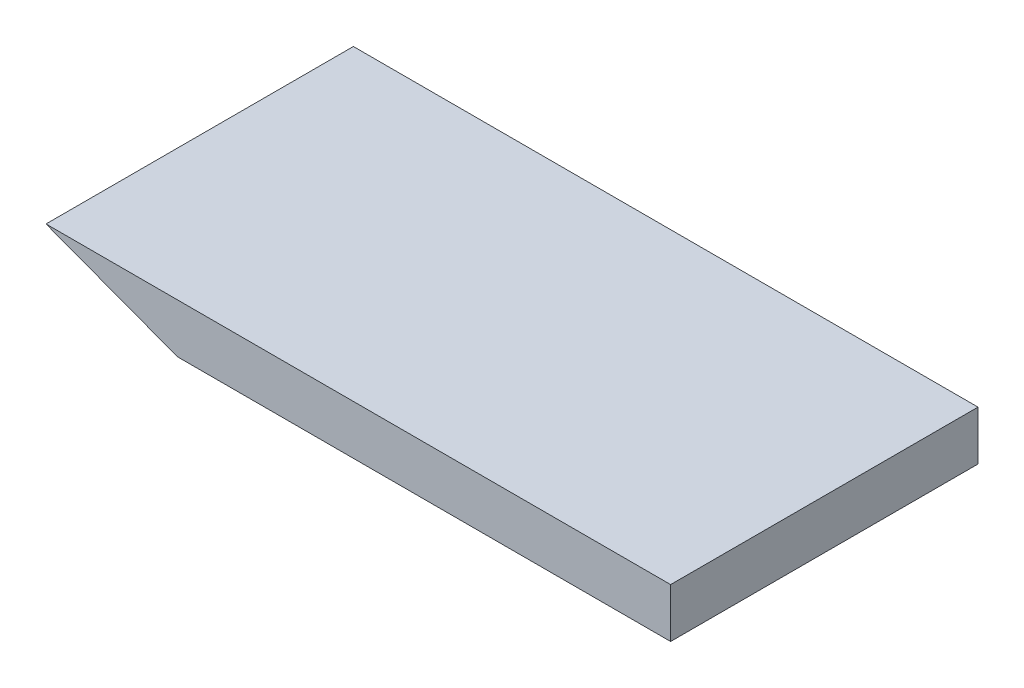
ISO-10303-21;
HEADER;
FILE_DESCRIPTION(('STEP AP214'),'2;1');
FILE_NAME('part.step','',(''),(''),'','','');
FILE_SCHEMA(('AUTOMOTIVE_DESIGN { 1 0 10303 214 1 1 1 1 }'));
ENDSEC;
DATA;
#1=APPLICATION_CONTEXT('core data for automotive mechanical design processes');
#2=APPLICATION_PROTOCOL_DEFINITION('international standard','automotive_design',2000,#1);
#3=PRODUCT_CONTEXT('',#1,'mechanical');
#4=PRODUCT('Part','Part','',(#3));
#5=PRODUCT_RELATED_PRODUCT_CATEGORY('part','',(#4));
#6=PRODUCT_DEFINITION_FORMATION('','',#4);
#7=PRODUCT_DEFINITION_CONTEXT('part definition',#1,'design');
#8=PRODUCT_DEFINITION('design','',#6,#7);
#9=PRODUCT_DEFINITION_SHAPE('','',#8);
#10=(LENGTH_UNIT() NAMED_UNIT(*) SI_UNIT(.MILLI.,.METRE.));
#11=(NAMED_UNIT(*) PLANE_ANGLE_UNIT() SI_UNIT($,.RADIAN.));
#12=(NAMED_UNIT(*) SI_UNIT($,.STERADIAN.) SOLID_ANGLE_UNIT());
#13=UNCERTAINTY_MEASURE_WITH_UNIT(LENGTH_MEASURE(1.E-05),#10,'distance_accuracy_value','');
#14=(GEOMETRIC_REPRESENTATION_CONTEXT(3) GLOBAL_UNCERTAINTY_ASSIGNED_CONTEXT((#13)) GLOBAL_UNIT_ASSIGNED_CONTEXT((#10,
#11,#12)) REPRESENTATION_CONTEXT('',''));
#15=CARTESIAN_POINT('',(0.,0.,0.));
#16=DIRECTION('',(0.,0.,1.));
#17=DIRECTION('',(1.,0.,0.));
#18=AXIS2_PLACEMENT_3D('',#15,#16,#17);
#19=CARTESIAN_POINT('',(19.,3.,-9.35));
#20=DIRECTION('',(-1.,0.,0.));
#21=DIRECTION('',(0.,0.,1.));
#22=AXIS2_PLACEMENT_3D('',#19,#20,#21);
#23=PLANE('',#22);
#24=DIRECTION('',(0.,0.,-1.));
#25=VECTOR('',#24,1.);
#26=CARTESIAN_POINT('',(19.,0.,-9.35));
#27=LINE('',#26,#25);
#28=CARTESIAN_POINT('',(19.,0.,9.35));
#29=VERTEX_POINT('',#28);
#30=CARTESIAN_POINT('',(19.,0.,-9.35));
#31=VERTEX_POINT('',#30);
#32=EDGE_CURVE('E91',#29,#31,#27,.T.);
#33=ORIENTED_EDGE('',*,*,#32,.T.);
#34=DIRECTION('',(0.,-1.,0.));
#35=VECTOR('',#34,1.);
#36=CARTESIAN_POINT('',(19.,3.,-9.35));
#37=LINE('',#36,#35);
#38=CARTESIAN_POINT('',(19.,3.,-9.35));
#39=VERTEX_POINT('',#38);
#40=EDGE_CURVE('E11',#39,#31,#37,.T.);
#41=ORIENTED_EDGE('',*,*,#40,.F.);
#42=DIRECTION('',(0.,0.,-1.));
#43=VECTOR('',#42,1.);
#44=CARTESIAN_POINT('',(19.,3.,-9.35));
#45=LINE('',#44,#43);
#46=CARTESIAN_POINT('',(19.,3.,9.35));
#47=VERTEX_POINT('',#46);
#48=EDGE_CURVE('E86',#47,#39,#45,.T.);
#49=ORIENTED_EDGE('',*,*,#48,.F.);
#50=DIRECTION('',(0.,-1.,0.));
#51=VECTOR('',#50,1.);
#52=CARTESIAN_POINT('',(19.,3.,9.35));
#53=LINE('',#52,#51);
#54=EDGE_CURVE('E48',#47,#29,#53,.T.);
#55=ORIENTED_EDGE('',*,*,#54,.T.);
#56=EDGE_LOOP('',(#33,#41,#49,#55));
#57=FACE_BOUND('',#56,.T.);
#58=ADVANCED_FACE('F39',(#57),#23,.F.);
#59=CARTESIAN_POINT('',(-19.,3.,-9.35));
#60=DIRECTION('',(0.,0.,1.));
#61=DIRECTION('',(1.,0.,0.));
#62=AXIS2_PLACEMENT_3D('',#59,#60,#61);
#63=PLANE('',#62);
#64=DIRECTION('',(-1.,0.,0.));
#65=VECTOR('',#64,1.);
#66=CARTESIAN_POINT('',(-19.,0.,-9.35));
#67=LINE('',#66,#65);
#68=CARTESIAN_POINT('',(-11.,0.,-9.35));
#69=VERTEX_POINT('',#68);
#70=EDGE_CURVE('E87',#31,#69,#67,.T.);
#71=ORIENTED_EDGE('',*,*,#70,.T.);
#72=DIRECTION('',(-0.936329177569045,0.351123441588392,0.));
#73=VECTOR('',#72,1.);
#74=CARTESIAN_POINT('',(-11.,0.,-9.35));
#75=LINE('',#74,#73);
#76=CARTESIAN_POINT('',(-19.,3.,-9.35));
#77=VERTEX_POINT('',#76);
#78=EDGE_CURVE('E55',#69,#77,#75,.T.);
#79=ORIENTED_EDGE('',*,*,#78,.T.);
#80=DIRECTION('',(-1.,0.,0.));
#81=VECTOR('',#80,1.);
#82=CARTESIAN_POINT('',(-19.,3.,-9.35));
#83=LINE('',#82,#81);
#84=EDGE_CURVE('E104',#39,#77,#83,.T.);
#85=ORIENTED_EDGE('',*,*,#84,.F.);
#86=ORIENTED_EDGE('',*,*,#40,.T.);
#87=EDGE_LOOP('',(#71,#79,#85,#86));
#88=FACE_BOUND('',#87,.T.);
#89=ADVANCED_FACE('F115',(#88),#63,.F.);
#90=CARTESIAN_POINT('',(-19.,3.,9.35));
#91=DIRECTION('',(0.,0.,-1.));
#92=DIRECTION('',(-1.,0.,0.));
#93=AXIS2_PLACEMENT_3D('',#90,#91,#92);
#94=PLANE('',#93);
#95=DIRECTION('',(1.,0.,0.));
#96=VECTOR('',#95,1.);
#97=CARTESIAN_POINT('',(-19.,3.,9.35));
#98=LINE('',#97,#96);
#99=CARTESIAN_POINT('',(-19.,3.,9.35));
#100=VERTEX_POINT('',#99);
#101=EDGE_CURVE('E64',#100,#47,#98,.T.);
#102=ORIENTED_EDGE('',*,*,#101,.F.);
#103=DIRECTION('',(0.936329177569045,-0.351123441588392,0.));
#104=VECTOR('',#103,1.);
#105=CARTESIAN_POINT('',(-19.,3.,9.35));
#106=LINE('',#105,#104);
#107=CARTESIAN_POINT('',(-11.,0.,9.350006));
#108=VERTEX_POINT('',#107);
#109=EDGE_CURVE('E83',#100,#108,#106,.T.);
#110=ORIENTED_EDGE('',*,*,#109,.T.);
#111=DIRECTION('',(1.,0.,0.));
#112=VECTOR('',#111,1.);
#113=CARTESIAN_POINT('',(-19.,0.,9.35));
#114=LINE('',#113,#112);
#115=EDGE_CURVE('E42',#108,#29,#114,.T.);
#116=ORIENTED_EDGE('',*,*,#115,.T.);
#117=ORIENTED_EDGE('',*,*,#54,.F.);
#118=EDGE_LOOP('',(#102,#110,#116,#117));
#119=FACE_BOUND('',#118,.T.);
#120=ADVANCED_FACE('F79',(#119),#94,.F.);
#121=CARTESIAN_POINT('',(0.,3.,0.));
#122=DIRECTION('',(0.,1.,0.));
#123=DIRECTION('',(0.,0.,1.));
#124=AXIS2_PLACEMENT_3D('',#121,#122,#123);
#125=PLANE('',#124);
#126=ORIENTED_EDGE('',*,*,#48,.T.);
#127=ORIENTED_EDGE('',*,*,#84,.T.);
#128=DIRECTION('',(0.,0.,1.));
#129=VECTOR('',#128,1.);
#130=CARTESIAN_POINT('',(-19.,3.,-9.35));
#131=LINE('',#130,#129);
#132=EDGE_CURVE('E102',#77,#100,#131,.T.);
#133=ORIENTED_EDGE('',*,*,#132,.T.);
#134=ORIENTED_EDGE('',*,*,#101,.T.);
#135=EDGE_LOOP('',(#126,#127,#133,#134));
#136=FACE_BOUND('',#135,.T.);
#137=ADVANCED_FACE('F117',(#136),#125,.T.);
#138=CARTESIAN_POINT('',(0.,0.,0.));
#139=DIRECTION('',(0.,1.,0.));
#140=DIRECTION('',(0.,0.,1.));
#141=AXIS2_PLACEMENT_3D('',#138,#139,#140);
#142=PLANE('',#141);
#143=ORIENTED_EDGE('',*,*,#115,.F.);
#144=DIRECTION('',(0.,0.,1.));
#145=VECTOR('',#144,1.);
#146=CARTESIAN_POINT('',(-11.,0.,-9.35));
#147=LINE('',#146,#145);
#148=EDGE_CURVE('E97',#69,#108,#147,.T.);
#149=ORIENTED_EDGE('',*,*,#148,.F.);
#150=ORIENTED_EDGE('',*,*,#70,.F.);
#151=ORIENTED_EDGE('',*,*,#32,.F.);
#152=EDGE_LOOP('',(#143,#149,#150,#151));
#153=FACE_BOUND('',#152,.T.);
#154=ADVANCED_FACE('F93',(#153),#142,.F.);
#155=CARTESIAN_POINT('',(-11.,0.,-9.35));
#156=DIRECTION('',(0.351123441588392,0.936329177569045,0.));
#157=DIRECTION('',(-0.936329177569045,0.351123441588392,0.));
#158=AXIS2_PLACEMENT_3D('',#155,#156,#157);
#159=PLANE('',#158);
#160=ORIENTED_EDGE('',*,*,#132,.F.);
#161=ORIENTED_EDGE('',*,*,#78,.F.);
#162=ORIENTED_EDGE('',*,*,#148,.T.);
#163=ORIENTED_EDGE('',*,*,#109,.F.);
#164=EDGE_LOOP('',(#160,#161,#162,#163));
#165=FACE_BOUND('',#164,.T.);
#166=ADVANCED_FACE('F118',(#165),#159,.F.);
#167=CLOSED_SHELL('',(#58,#89,#120,#137,#154,#166));
#168=MANIFOLD_SOLID_BREP('B2',#167);
#169=ADVANCED_BREP_SHAPE_REPRESENTATION('',(#18,#168),#14);
#170=SHAPE_DEFINITION_REPRESENTATION(#9,#169);
ENDSEC;
END-ISO-10303-21;
